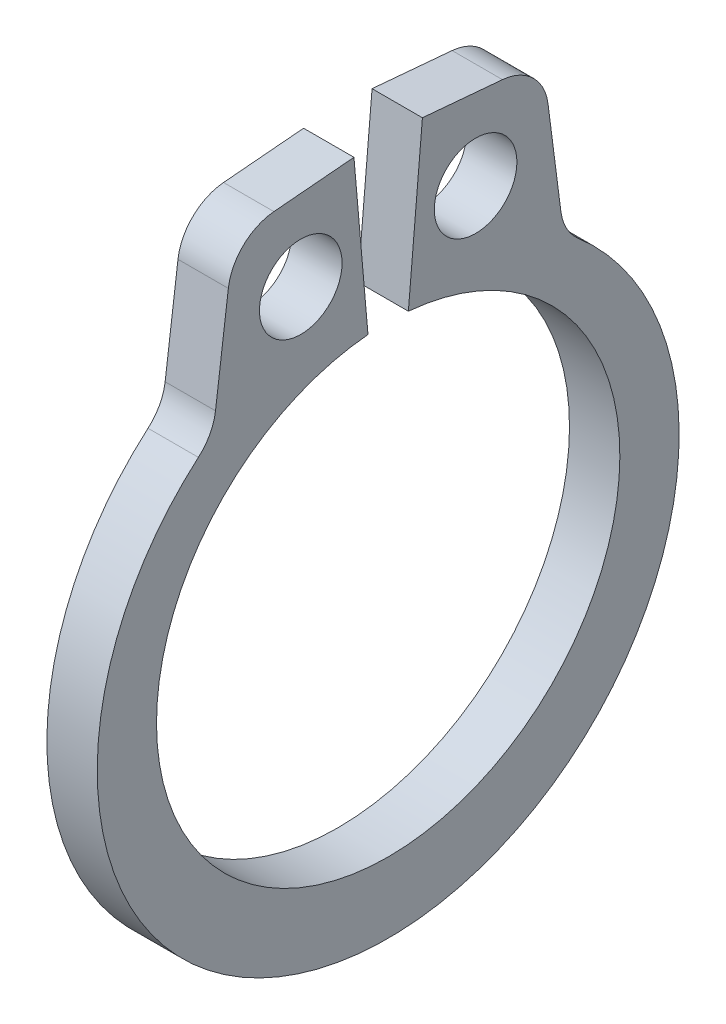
from build123d import *

# Parameters (mm, degrees)
SKETCH1_R      = 0.5207
EXTRUDE1_DEPTH = 0.3175
FILLET1_R      = 0.635


with BuildPart() as part:
    # Sketch1 → Extrude1 (new, symmetric)
    with BuildSketch(Plane(origin=(0, 0, 0), x_dir=(0, 0, -1), z_dir=(1, 0, 0))):
        with BuildLine():
            Line((-0.254581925, 2.909884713), (-0.431682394, 4.93415234))
            Line((-0.431682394, 4.93415234), (-1.949883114, 4.801326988))
            Line((-1.949883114, 4.801326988), (-2.20980377, 2.786019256))
            ThreePointArc((-2.20980377, 2.786019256), (0, -3.81), (2.20980377, 2.786019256))
            Line((2.20980377, 2.786019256), (1.949883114, 4.801326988))
            Line((1.949883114, 4.801326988), (0.431682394, 4.93415234))
            Line((0.431682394, 4.93415234), (0.254581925, 2.909884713))
            ThreePointArc((0.254581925, 2.909884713), (0, -2.921), (-0.254581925, 2.909884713))
        make_face()
        with Locations((-1.102232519, 3.85560585)):
            Circle(SKETCH1_R, mode=Mode.SUBTRACT)
        with Locations((1.102232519, 3.85560585)):
            Circle(SKETCH1_R, mode=Mode.SUBTRACT)
    extrude(amount=EXTRUDE1_DEPTH, both=True)

    # Fillet1
    fillet1_edges = [part.edges().sort_by_distance(p)[0] for p in [
        (0, 4.801326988, -1.949883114),
        (0, 2.786019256, -2.20980377),
        (0, 2.786019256, 2.20980377),
        (0, 4.801326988, 1.949883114),
    ]]
    fillet(fillet1_edges, radius=FILLET1_R)


solid = part.part
